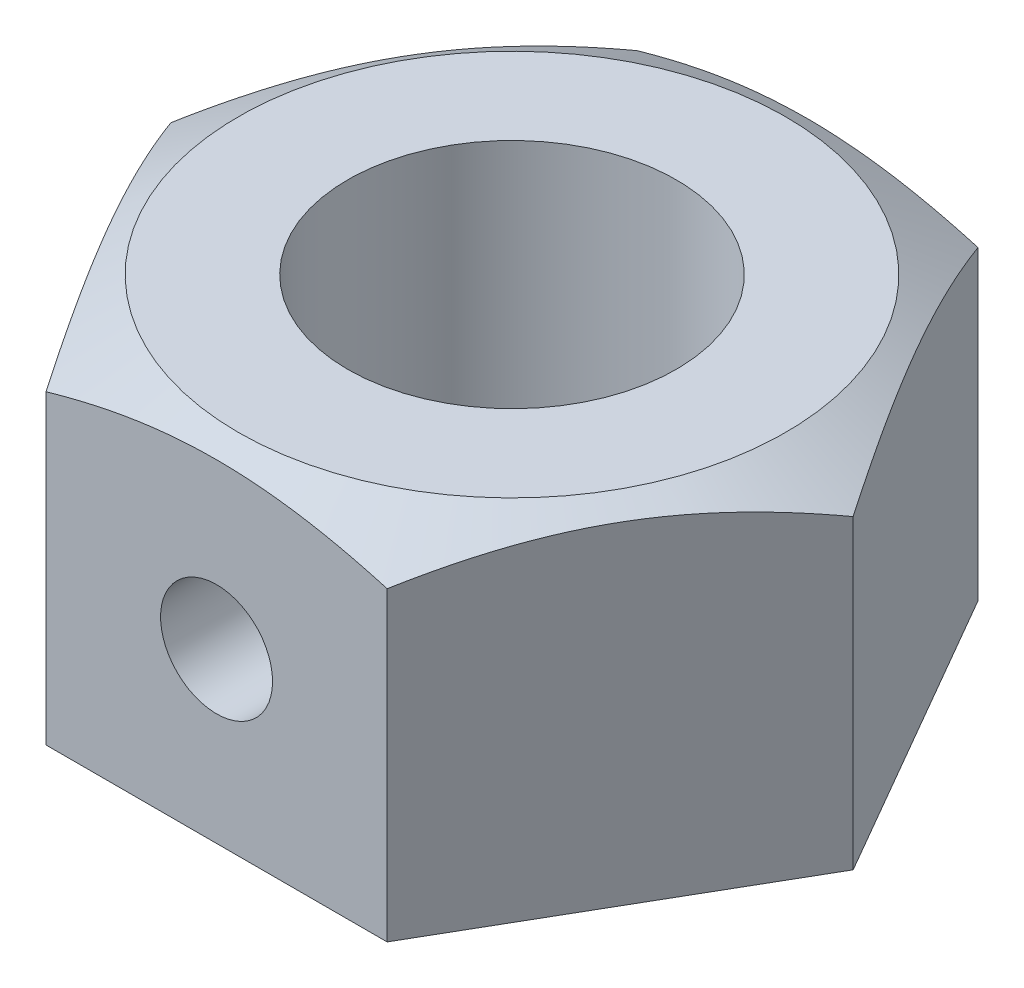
ISO-10303-21;
HEADER;
FILE_DESCRIPTION(('STEP AP214'),'2;1');
FILE_NAME('part.step','',(''),(''),'','','');
FILE_SCHEMA(('AUTOMOTIVE_DESIGN { 1 0 10303 214 1 1 1 1 }'));
ENDSEC;
DATA;
#1=APPLICATION_CONTEXT('core data for automotive mechanical design processes');
#2=APPLICATION_PROTOCOL_DEFINITION('international standard','automotive_design',2000,#1);
#3=PRODUCT_CONTEXT('',#1,'mechanical');
#4=PRODUCT('Part','Part','',(#3));
#5=PRODUCT_RELATED_PRODUCT_CATEGORY('part','',(#4));
#6=PRODUCT_DEFINITION_FORMATION('','',#4);
#7=PRODUCT_DEFINITION_CONTEXT('part definition',#1,'design');
#8=PRODUCT_DEFINITION('design','',#6,#7);
#9=PRODUCT_DEFINITION_SHAPE('','',#8);
#10=(LENGTH_UNIT() NAMED_UNIT(*) SI_UNIT(.MILLI.,.METRE.));
#11=(NAMED_UNIT(*) PLANE_ANGLE_UNIT() SI_UNIT($,.RADIAN.));
#12=(NAMED_UNIT(*) SI_UNIT($,.STERADIAN.) SOLID_ANGLE_UNIT());
#13=UNCERTAINTY_MEASURE_WITH_UNIT(LENGTH_MEASURE(1.E-05),#10,'distance_accuracy_value','');
#14=(GEOMETRIC_REPRESENTATION_CONTEXT(3) GLOBAL_UNCERTAINTY_ASSIGNED_CONTEXT((#13)) GLOBAL_UNIT_ASSIGNED_CONTEXT((#10,
#11,#12)) REPRESENTATION_CONTEXT('',''));
#15=CARTESIAN_POINT('',(0.,0.,0.));
#16=DIRECTION('',(0.,0.,1.));
#17=DIRECTION('',(1.,0.,0.));
#18=AXIS2_PLACEMENT_3D('',#15,#16,#17);
#19=CARTESIAN_POINT('',(-4.12077981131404,8.33374,7.13740000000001));
#20=DIRECTION('',(0.,0.,-1.));
#21=DIRECTION('',(-1.,0.,0.));
#22=AXIS2_PLACEMENT_3D('',#19,#20,#21);
#23=PLANE('',#22);
#24=CARTESIAN_POINT('',(0.,4.064,7.13740000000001));
#25=DIRECTION('',(0.,0.,1.));
#26=DIRECTION('',(1.,0.,0.));
#27=AXIS2_PLACEMENT_3D('',#24,#25,#26);
#28=CIRCLE('',#27,1.35254999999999);
#29=CARTESIAN_POINT('',(1.35254999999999,4.064,7.13740000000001));
#30=VERTEX_POINT('',#29);
#31=EDGE_CURVE('E1261',#30,#30,#28,.T.);
#32=ORIENTED_EDGE('',*,*,#31,.F.);
#33=EDGE_LOOP('',(#32));
#34=FACE_BOUND('',#33,.T.);
#35=CARTESIAN_POINT('',(-10.9603843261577,4.59781002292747,7.13740000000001));
#36=CARTESIAN_POINT('',(-10.6495312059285,4.74816191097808,7.13740000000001));
#37=CARTESIAN_POINT('',(-10.3379527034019,4.89704034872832,7.13740000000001));
#38=CARTESIAN_POINT('',(-9.71295871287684,5.1910193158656,7.13740000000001));
#39=CARTESIAN_POINT('',(-9.39954293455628,5.33611922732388,7.13740000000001));
#40=CARTESIAN_POINT('',(-8.76882069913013,5.62246350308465,7.13740000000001));
#41=CARTESIAN_POINT('',(-8.45150227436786,5.76368160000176,7.13740000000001));
#42=CARTESIAN_POINT('',(-7.81430318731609,6.04019133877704,7.13740000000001));
#43=CARTESIAN_POINT('',(-7.49442265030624,6.1754832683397,7.13740000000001));
#44=CARTESIAN_POINT('',(-6.84171298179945,6.44261472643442,7.13740000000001));
#45=CARTESIAN_POINT('',(-6.50878777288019,6.5742208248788,7.13740000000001));
#46=CARTESIAN_POINT('',(-5.83900334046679,6.8272071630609,7.13740000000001));
#47=CARTESIAN_POINT('',(-5.50214367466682,6.94858624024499,7.13740000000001));
#48=CARTESIAN_POINT('',(-4.82461667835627,7.17785195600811,7.13740000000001));
#49=CARTESIAN_POINT('',(-4.48395902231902,7.28576687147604,7.13740000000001));
#50=CARTESIAN_POINT('',(-3.79777170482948,7.48457190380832,7.13740000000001));
#51=CARTESIAN_POINT('',(-3.4522436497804,7.575467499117,7.13740000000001));
#52=CARTESIAN_POINT('',(-2.7579470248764,7.73531988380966,7.13740000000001));
#53=CARTESIAN_POINT('',(-2.40920547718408,7.8043908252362,7.13740000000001));
#54=CARTESIAN_POINT('',(-1.88300620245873,7.88858274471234,7.13740000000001));
#55=CARTESIAN_POINT('',(-1.7070782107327,7.91341213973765,7.13740000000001));
#56=CARTESIAN_POINT('',(-1.35438520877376,7.95611015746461,7.13740000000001));
#57=CARTESIAN_POINT('',(-1.17762028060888,7.97397944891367,7.13740000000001));
#58=CARTESIAN_POINT('',(-0.825751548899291,8.00218265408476,7.13740000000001));
#59=CARTESIAN_POINT('',(-0.650655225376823,8.01260954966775,7.13740000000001));
#60=CARTESIAN_POINT('',(-0.300178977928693,8.02605767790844,7.13740000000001));
#61=CARTESIAN_POINT('',(-0.124799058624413,8.02907903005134,7.13740000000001));
#62=CARTESIAN_POINT('',(0.22593245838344,8.02764419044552,7.13740000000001));
#63=CARTESIAN_POINT('',(0.401284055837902,8.02318793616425,7.13740000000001));
#64=CARTESIAN_POINT('',(0.751647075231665,8.00690477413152,7.13740000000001));
#65=CARTESIAN_POINT('',(0.926658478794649,7.99507747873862,7.13740000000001));
#66=CARTESIAN_POINT('',(1.3505989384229,7.95774609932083,7.13740000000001));
#67=CARTESIAN_POINT('',(1.59921024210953,7.92855986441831,7.13740000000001));
#68=CARTESIAN_POINT('',(2.09450393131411,7.8569311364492,7.13740000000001));
#69=CARTESIAN_POINT('',(2.34118603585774,7.81448674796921,7.13740000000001));
#70=CARTESIAN_POINT('',(3.07810286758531,7.66952428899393,7.13740000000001));
#71=CARTESIAN_POINT('',(3.56491649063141,7.54940591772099,7.13740000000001));
#72=CARTESIAN_POINT('',(4.29271884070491,7.34216464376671,7.13740000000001));
#73=CARTESIAN_POINT('',(4.53750806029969,7.26762997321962,7.13740000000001));
#74=CARTESIAN_POINT('',(5.02470727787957,7.11108354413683,7.13740000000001));
#75=CARTESIAN_POINT('',(5.26711726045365,7.02907173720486,7.1374));
#76=CARTESIAN_POINT('',(5.74963966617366,6.85886483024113,7.1374));
#77=CARTESIAN_POINT('',(5.98975287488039,6.7706719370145,7.1374));
#78=CARTESIAN_POINT('',(6.4680075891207,6.58911411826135,7.1374));
#79=CARTESIAN_POINT('',(6.7061491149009,6.49574924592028,7.1374));
#80=CARTESIAN_POINT('',(7.25623375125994,6.27429607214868,7.1374));
#81=CARTESIAN_POINT('',(7.56753490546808,6.14461637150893,7.1374));
#82=CARTESIAN_POINT('',(8.18760252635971,5.87931600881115,7.1374));
#83=CARTESIAN_POINT('',(8.49636885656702,5.74369502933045,7.1374));
#84=CARTESIAN_POINT('',(9.11181883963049,5.46767389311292,7.1374));
#85=CARTESIAN_POINT('',(9.41850210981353,5.32727288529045,7.1374));
#86=CARTESIAN_POINT('',(10.0300802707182,5.0426218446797,7.1374));
#87=CARTESIAN_POINT('',(10.3349751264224,4.8983717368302,7.1374));
#88=CARTESIAN_POINT('',(10.9435537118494,4.60658664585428,7.1374));
#89=CARTESIAN_POINT('',(11.2472359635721,4.45904858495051,7.1374));
#90=CARTESIAN_POINT('',(11.8533233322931,4.16136983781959,7.1374));
#91=CARTESIAN_POINT('',(12.1557284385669,4.01122912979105,7.1374));
#92=CARTESIAN_POINT('',(13.0612540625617,3.55761431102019,7.1374));
#93=CARTESIAN_POINT('',(13.6627575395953,3.25091239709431,7.1374));
#94=CARTESIAN_POINT('',(14.8143604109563,2.65631457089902,7.1374));
#95=CARTESIAN_POINT('',(15.3647039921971,2.36888955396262,7.1374));
#96=CARTESIAN_POINT('',(16.4633511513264,1.79012802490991,7.1374));
#97=CARTESIAN_POINT('',(17.0116546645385,1.49879139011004,7.1374));
#98=CARTESIAN_POINT('',(18.1054046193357,0.913798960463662,7.1374));
#99=CARTESIAN_POINT('',(18.6508547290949,0.62015001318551,7.1374));
#100=CARTESIAN_POINT('',(19.7404438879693,0.030494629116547,7.1374));
#101=CARTESIAN_POINT('',(20.2845830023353,-0.265511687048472,7.1374));
#102=CARTESIAN_POINT('',(20.8282361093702,-0.562402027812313,7.1374));
#103=B_SPLINE_CURVE_WITH_KNOTS('',3,(#35,#36,#37,#38,#39,#40,#41,#42,#43,#44,#45,#46,#47,#48,
#49,#50,#51,#52,#53,#54,#55,#56,#57,#58,#59,#60,#61,#62,#63,#64,#65,#66,#67,#68,#69,#70,#71,#72,
#73,#74,#75,#76,#77,#78,#79,#80,#81,#82,#83,#84,#85,#86,#87,#88,#89,#90,#91,#92,#93,#94,#95,#96,
#97,#98,#99,#100,#101,#102),.UNSPECIFIED.,.F.,.F.,(4,2,2,2,2,2,2,2,2,2,2,2,2,2,2,2,2,2,2,2,2,2,
2,2,2,2,2,2,2,2,2,2,2,4),(0.,1.0359273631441,2.07202308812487,3.11394475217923,4.15581577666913,
5.22966604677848,6.30363822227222,7.3753154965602,8.44664720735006,9.51227891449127,
10.0451772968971,10.5780244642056,11.1040920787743,11.6301512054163,12.1562147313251,
12.6823059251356,13.4328354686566,14.1834723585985,15.6856214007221,16.4532161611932,
17.2208158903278,17.9881429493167,18.755462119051,19.7670753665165,20.778742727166,
21.790591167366,22.8024593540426,23.8153182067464,24.828185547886,26.8536781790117,
28.7162994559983,30.5789792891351,32.4373890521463,34.2957043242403),.UNSPECIFIED.);
#104=CARTESIAN_POINT('',(-4.12077981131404,7.3909781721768,7.13740000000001));
#105=VERTEX_POINT('',#104);
#106=CARTESIAN_POINT('',(4.12077981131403,7.3909781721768,7.13740000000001));
#107=VERTEX_POINT('',#106);
#108=EDGE_CURVE('E1253',#105,#107,#103,.T.);
#109=ORIENTED_EDGE('',*,*,#108,.F.);
#110=DIRECTION('',(0.,-1.,0.));
#111=VECTOR('',#110,1.);
#112=CARTESIAN_POINT('',(-4.12077981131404,8.33374,7.13740000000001));
#113=LINE('',#112,#111);
#114=CARTESIAN_POINT('',(-4.12077981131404,0.,7.13740000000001));
#115=VERTEX_POINT('',#114);
#116=EDGE_CURVE('E1259',#105,#115,#113,.T.);
#117=ORIENTED_EDGE('',*,*,#116,.T.);
#118=DIRECTION('',(1.,0.,0.));
#119=VECTOR('',#118,1.);
#120=CARTESIAN_POINT('',(-4.12077981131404,0.,7.13740000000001));
#121=LINE('',#120,#119);
#122=CARTESIAN_POINT('',(4.12077981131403,0.,7.13740000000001));
#123=VERTEX_POINT('',#122);
#124=EDGE_CURVE('E1272',#115,#123,#121,.T.);
#125=ORIENTED_EDGE('',*,*,#124,.T.);
#126=DIRECTION('',(0.,-1.,0.));
#127=VECTOR('',#126,1.);
#128=CARTESIAN_POINT('',(4.12077981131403,8.33374,7.13740000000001));
#129=LINE('',#128,#127);
#130=EDGE_CURVE('E1222',#107,#123,#129,.T.);
#131=ORIENTED_EDGE('',*,*,#130,.F.);
#132=EDGE_LOOP('',(#109,#117,#125,#131));
#133=FACE_BOUND('',#132,.T.);
#134=ADVANCED_FACE('F1197',(#34,#133),#23,.F.);
#135=CARTESIAN_POINT('',(4.12077981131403,8.33374,7.13740000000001));
#136=DIRECTION('',(-0.866025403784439,0.,-0.5));
#137=DIRECTION('',(-0.5,0.,0.866025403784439));
#138=AXIS2_PLACEMENT_3D('',#135,#136,#137);
#139=PLANE('',#138);
#140=CARTESIAN_POINT('',(4.12066434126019,7.39091150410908,7.13760000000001));
#141=CARTESIAN_POINT('',(4.21124371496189,7.44319963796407,6.98071192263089));
#142=CARTESIAN_POINT('',(4.30216081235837,7.49311473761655,6.82323889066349));
#143=CARTESIAN_POINT('',(4.48473335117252,7.58754528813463,6.50701397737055));
#144=CARTESIAN_POINT('',(4.57638909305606,7.63205840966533,6.34826157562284));
#145=CARTESIAN_POINT('',(4.85282383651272,7.75662108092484,5.86946255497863));
#146=CARTESIAN_POINT('',(5.03869401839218,7.82747090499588,5.54752595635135));
#147=CARTESIAN_POINT('',(5.31684536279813,7.91055067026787,5.06575369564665));
#148=CARTESIAN_POINT('',(5.40829544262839,7.93421768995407,4.90735751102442));
#149=CARTESIAN_POINT('',(5.59160881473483,7.97390382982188,4.58984943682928));
#150=CARTESIAN_POINT('',(5.68347206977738,7.98992362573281,4.43073761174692));
#151=CARTESIAN_POINT('',(5.86735812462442,8.01390704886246,4.11223762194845));
#152=CARTESIAN_POINT('',(5.95938062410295,8.02187981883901,3.95284997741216));
#153=CARTESIAN_POINT('',(6.14350554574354,8.02960678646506,3.63393625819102));
#154=CARTESIAN_POINT('',(6.23560796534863,8.0293612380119,3.47441018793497));
#155=CARTESIAN_POINT('',(6.48793781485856,8.01739197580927,3.03736206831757));
#156=CARTESIAN_POINT('',(6.64808264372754,7.99729914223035,2.75998308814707));
#157=CARTESIAN_POINT('',(6.96730863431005,7.93358493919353,2.20706745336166));
#158=CARTESIAN_POINT('',(7.12638867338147,7.88994179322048,1.93153274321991));
#159=CARTESIAN_POINT('',(7.44625708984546,7.78084672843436,1.37750439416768));
#160=CARTESIAN_POINT('',(7.60700510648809,7.71493259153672,1.09908066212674));
#161=CARTESIAN_POINT('',(7.92610395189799,7.56533414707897,0.546385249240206));
#162=CARTESIAN_POINT('',(8.08445886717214,7.48168497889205,0.272106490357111));
#163=CARTESIAN_POINT('',(8.24167509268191,7.39091150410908,-0.00020000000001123));
#164=B_SPLINE_CURVE_WITH_KNOTS('',3,(#140,#141,#142,#143,#144,#145,#146,#147,#148,#149,#150,
#151,#152,#153,#154,#155,#156,#157,#158,#159,#160,#161,#162,#163),.UNSPECIFIED.,.F.,.F.,(4,2,2,
2,2,2,2,2,2,2,2,4),(0.,0.565616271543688,1.13147557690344,2.26554547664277,2.81869146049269,
3.37178855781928,3.9242565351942,4.47670744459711,5.43845614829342,6.40109569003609,
7.38508511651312,8.36714283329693),.UNSPECIFIED.);
#165=CARTESIAN_POINT('',(8.24155962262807,7.3909781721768,0.));
#166=VERTEX_POINT('',#165);
#167=EDGE_CURVE('E1262',#107,#166,#164,.T.);
#168=ORIENTED_EDGE('',*,*,#167,.F.);
#169=ORIENTED_EDGE('',*,*,#130,.T.);
#170=DIRECTION('',(0.5,0.,-0.866025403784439));
#171=VECTOR('',#170,1.);
#172=CARTESIAN_POINT('',(4.12077981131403,0.,7.13740000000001));
#173=LINE('',#172,#171);
#174=CARTESIAN_POINT('',(8.24155962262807,0.,0.));
#175=VERTEX_POINT('',#174);
#176=EDGE_CURVE('E1296',#123,#175,#173,.T.);
#177=ORIENTED_EDGE('',*,*,#176,.T.);
#178=DIRECTION('',(0.,-1.,0.));
#179=VECTOR('',#178,1.);
#180=CARTESIAN_POINT('',(8.24155962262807,8.33374,0.));
#181=LINE('',#180,#179);
#182=EDGE_CURVE('E12',#166,#175,#181,.T.);
#183=ORIENTED_EDGE('',*,*,#182,.F.);
#184=EDGE_LOOP('',(#168,#169,#177,#183));
#185=FACE_BOUND('',#184,.T.);
#186=ADVANCED_FACE('F1199',(#185),#139,.F.);
#187=CARTESIAN_POINT('',(8.24155962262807,8.33374,0.));
#188=DIRECTION('',(-0.866025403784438,0.,0.5));
#189=DIRECTION('',(0.5,0.,0.866025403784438));
#190=AXIS2_PLACEMENT_3D('',#187,#188,#189);
#191=PLANE('',#190);
#192=CARTESIAN_POINT('',(8.24167509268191,7.39091150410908,0.000199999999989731));
#193=CARTESIAN_POINT('',(8.15109571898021,7.44319963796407,-0.156688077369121));
#194=CARTESIAN_POINT('',(8.06017862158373,7.49311473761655,-0.314161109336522));
#195=CARTESIAN_POINT('',(7.87760608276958,7.58754528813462,-0.630386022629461));
#196=CARTESIAN_POINT('',(7.78595034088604,7.63205840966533,-0.789138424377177));
#197=CARTESIAN_POINT('',(7.50951559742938,7.75662108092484,-1.26793744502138));
#198=CARTESIAN_POINT('',(7.32364541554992,7.82747090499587,-1.58987404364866));
#199=CARTESIAN_POINT('',(7.04549407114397,7.91055067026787,-2.07164630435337));
#200=CARTESIAN_POINT('',(6.95404399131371,7.93421768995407,-2.2300424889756));
#201=CARTESIAN_POINT('',(6.77073061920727,7.97390382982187,-2.54755056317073));
#202=CARTESIAN_POINT('',(6.67886736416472,7.9899236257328,-2.70666238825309));
#203=CARTESIAN_POINT('',(6.49498130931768,8.01390704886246,-3.02516237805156));
#204=CARTESIAN_POINT('',(6.40295880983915,8.02187981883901,-3.18455002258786));
#205=CARTESIAN_POINT('',(6.21883388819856,8.02960678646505,-3.503463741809));
#206=CARTESIAN_POINT('',(6.12673146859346,8.0293612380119,-3.66298981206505));
#207=CARTESIAN_POINT('',(5.87440161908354,8.01739197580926,-4.10003793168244));
#208=CARTESIAN_POINT('',(5.71425679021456,7.99729914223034,-4.37741691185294));
#209=CARTESIAN_POINT('',(5.39503079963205,7.93358493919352,-4.93033254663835));
#210=CARTESIAN_POINT('',(5.23595076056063,7.88994179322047,-5.2058672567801));
#211=CARTESIAN_POINT('',(4.91608234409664,7.78084672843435,-5.75989560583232));
#212=CARTESIAN_POINT('',(4.75533432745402,7.71493259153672,-6.03831933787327));
#213=CARTESIAN_POINT('',(4.43623548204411,7.56533414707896,-6.5910147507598));
#214=CARTESIAN_POINT('',(4.27788056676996,7.48168497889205,-6.86529350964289));
#215=CARTESIAN_POINT('',(4.12066434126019,7.39091150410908,-7.13760000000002));
#216=B_SPLINE_CURVE_WITH_KNOTS('',3,(#192,#193,#194,#195,#196,#197,#198,#199,#200,#201,#202,
#203,#204,#205,#206,#207,#208,#209,#210,#211,#212,#213,#214,#215),.UNSPECIFIED.,.F.,.F.,(4,2,2,
2,2,2,2,2,2,2,2,4),(0.,0.565616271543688,1.13147557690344,2.26554547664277,2.81869146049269,
3.37178855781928,3.92425653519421,4.47670744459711,5.43845614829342,6.40109569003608,
7.38508511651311,8.36714283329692),.UNSPECIFIED.);
#217=CARTESIAN_POINT('',(4.12077981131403,7.3909781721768,-7.13740000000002));
#218=VERTEX_POINT('',#217);
#219=EDGE_CURVE('E1350',#166,#218,#216,.T.);
#220=ORIENTED_EDGE('',*,*,#219,.F.);
#221=ORIENTED_EDGE('',*,*,#182,.T.);
#222=DIRECTION('',(-0.5,0.,-0.866025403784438));
#223=VECTOR('',#222,1.);
#224=CARTESIAN_POINT('',(8.24155962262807,0.,0.));
#225=LINE('',#224,#223);
#226=CARTESIAN_POINT('',(4.12077981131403,0.,-7.13740000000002));
#227=VERTEX_POINT('',#226);
#228=EDGE_CURVE('E1291',#175,#227,#225,.T.);
#229=ORIENTED_EDGE('',*,*,#228,.T.);
#230=DIRECTION('',(0.,-1.,0.));
#231=VECTOR('',#230,1.);
#232=CARTESIAN_POINT('',(4.12077981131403,8.33374,-7.13740000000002));
#233=LINE('',#232,#231);
#234=EDGE_CURVE('E1207',#218,#227,#233,.T.);
#235=ORIENTED_EDGE('',*,*,#234,.F.);
#236=EDGE_LOOP('',(#220,#221,#229,#235));
#237=FACE_BOUND('',#236,.T.);
#238=ADVANCED_FACE('F1292',(#237),#191,.F.);
#239=CARTESIAN_POINT('',(4.12077981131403,8.33374,-7.13740000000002));
#240=DIRECTION('',(0.,0.,1.));
#241=DIRECTION('',(1.,0.,0.));
#242=AXIS2_PLACEMENT_3D('',#239,#240,#241);
#243=PLANE('',#242);
#244=CARTESIAN_POINT('',(-10.9603843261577,4.59781002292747,-7.13740000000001));
#245=CARTESIAN_POINT('',(-10.6495312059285,4.74816191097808,-7.13740000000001));
#246=CARTESIAN_POINT('',(-10.3379527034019,4.89704034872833,-7.13740000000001));
#247=CARTESIAN_POINT('',(-9.71295871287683,5.1910193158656,-7.13740000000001));
#248=CARTESIAN_POINT('',(-9.39954293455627,5.33611922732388,-7.13740000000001));
#249=CARTESIAN_POINT('',(-8.76882069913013,5.62246350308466,-7.13740000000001));
#250=CARTESIAN_POINT('',(-8.45150227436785,5.76368160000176,-7.13740000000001));
#251=CARTESIAN_POINT('',(-7.81430318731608,6.04019133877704,-7.13740000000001));
#252=CARTESIAN_POINT('',(-7.49442265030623,6.1754832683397,-7.13740000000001));
#253=CARTESIAN_POINT('',(-6.84171298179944,6.44261472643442,-7.13740000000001));
#254=CARTESIAN_POINT('',(-6.50878777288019,6.57422082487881,-7.13740000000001));
#255=CARTESIAN_POINT('',(-5.83900334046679,6.8272071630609,-7.13740000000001));
#256=CARTESIAN_POINT('',(-5.50214367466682,6.94858624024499,-7.13740000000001));
#257=CARTESIAN_POINT('',(-4.82461667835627,7.17785195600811,-7.13740000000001));
#258=CARTESIAN_POINT('',(-4.48395902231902,7.28576687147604,-7.13740000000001));
#259=CARTESIAN_POINT('',(-3.79777170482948,7.48457190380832,-7.13740000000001));
#260=CARTESIAN_POINT('',(-3.45224364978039,7.575467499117,-7.13740000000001));
#261=CARTESIAN_POINT('',(-2.75794702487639,7.73531988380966,-7.13740000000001));
#262=CARTESIAN_POINT('',(-2.40920547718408,7.80439082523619,-7.13740000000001));
#263=CARTESIAN_POINT('',(-1.88300620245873,7.88858274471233,-7.13740000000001));
#264=CARTESIAN_POINT('',(-1.7070782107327,7.91341213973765,-7.13740000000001));
#265=CARTESIAN_POINT('',(-1.35438520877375,7.95611015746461,-7.13740000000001));
#266=CARTESIAN_POINT('',(-1.17762028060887,7.97397944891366,-7.13740000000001));
#267=CARTESIAN_POINT('',(-0.825751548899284,8.00218265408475,-7.13740000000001));
#268=CARTESIAN_POINT('',(-0.650655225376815,8.01260954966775,-7.13740000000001));
#269=CARTESIAN_POINT('',(-0.300178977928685,8.02605767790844,-7.13740000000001));
#270=CARTESIAN_POINT('',(-0.124799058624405,8.02907903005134,-7.13740000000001));
#271=CARTESIAN_POINT('',(0.225932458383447,8.02764419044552,-7.13740000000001));
#272=CARTESIAN_POINT('',(0.40128405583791,8.02318793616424,-7.13740000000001));
#273=CARTESIAN_POINT('',(0.751647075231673,8.00690477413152,-7.13740000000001));
#274=CARTESIAN_POINT('',(0.926658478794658,7.99507747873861,-7.13740000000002));
#275=CARTESIAN_POINT('',(1.35059893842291,7.95774609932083,-7.13740000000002));
#276=CARTESIAN_POINT('',(1.59921024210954,7.92855986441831,-7.13740000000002));
#277=CARTESIAN_POINT('',(2.09450393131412,7.8569311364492,-7.13740000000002));
#278=CARTESIAN_POINT('',(2.34118603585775,7.8144867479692,-7.13740000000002));
#279=CARTESIAN_POINT('',(3.07810286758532,7.66952428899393,-7.13740000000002));
#280=CARTESIAN_POINT('',(3.56491649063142,7.54940591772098,-7.13740000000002));
#281=CARTESIAN_POINT('',(4.29271884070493,7.3421646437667,-7.13740000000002));
#282=CARTESIAN_POINT('',(4.53750806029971,7.2676299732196,-7.13740000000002));
#283=CARTESIAN_POINT('',(5.02470727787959,7.11108354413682,-7.13740000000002));
#284=CARTESIAN_POINT('',(5.26711726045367,7.02907173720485,-7.13740000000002));
#285=CARTESIAN_POINT('',(5.74963966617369,6.85886483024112,-7.13740000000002));
#286=CARTESIAN_POINT('',(5.98975287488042,6.77067193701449,-7.13740000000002));
#287=CARTESIAN_POINT('',(6.46800758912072,6.58911411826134,-7.13740000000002));
#288=CARTESIAN_POINT('',(6.70614911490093,6.49574924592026,-7.13740000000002));
#289=CARTESIAN_POINT('',(7.25623375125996,6.27429607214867,-7.13740000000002));
#290=CARTESIAN_POINT('',(7.5675349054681,6.14461637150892,-7.13740000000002));
#291=CARTESIAN_POINT('',(8.18760252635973,5.87931600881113,-7.13740000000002));
#292=CARTESIAN_POINT('',(8.49636885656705,5.74369502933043,-7.13740000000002));
#293=CARTESIAN_POINT('',(9.11181883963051,5.46767389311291,-7.13740000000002));
#294=CARTESIAN_POINT('',(9.41850210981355,5.32727288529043,-7.13740000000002));
#295=CARTESIAN_POINT('',(10.0300802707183,5.04262184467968,-7.13740000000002));
#296=CARTESIAN_POINT('',(10.3349751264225,4.89837173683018,-7.13740000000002));
#297=CARTESIAN_POINT('',(10.9435537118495,4.60658664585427,-7.13740000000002));
#298=CARTESIAN_POINT('',(11.2472359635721,4.4590485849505,-7.13740000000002));
#299=CARTESIAN_POINT('',(11.8533233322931,4.16136983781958,-7.13740000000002));
#300=CARTESIAN_POINT('',(12.1557284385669,4.01122912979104,-7.13740000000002));
#301=CARTESIAN_POINT('',(13.0612540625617,3.55761431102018,-7.13740000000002));
#302=CARTESIAN_POINT('',(13.6627575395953,3.2509123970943,-7.13740000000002));
#303=CARTESIAN_POINT('',(14.8143604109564,2.656314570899,-7.13740000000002));
#304=CARTESIAN_POINT('',(15.3647039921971,2.36888955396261,-7.13740000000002));
#305=CARTESIAN_POINT('',(16.4633511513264,1.79012802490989,-7.13740000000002));
#306=CARTESIAN_POINT('',(17.0116546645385,1.49879139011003,-7.13740000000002));
#307=CARTESIAN_POINT('',(18.1054046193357,0.913798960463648,-7.13740000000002));
#308=CARTESIAN_POINT('',(18.650854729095,0.620150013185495,-7.13740000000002));
#309=CARTESIAN_POINT('',(19.7404438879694,0.0304946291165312,-7.13740000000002));
#310=CARTESIAN_POINT('',(20.2845830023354,-0.265511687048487,-7.13740000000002));
#311=CARTESIAN_POINT('',(20.8282361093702,-0.562402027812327,-7.13740000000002));
#312=B_SPLINE_CURVE_WITH_KNOTS('',3,(#244,#245,#246,#247,#248,#249,#250,#251,#252,#253,#254,
#255,#256,#257,#258,#259,#260,#261,#262,#263,#264,#265,#266,#267,#268,#269,#270,#271,#272,#273,
#274,#275,#276,#277,#278,#279,#280,#281,#282,#283,#284,#285,#286,#287,#288,#289,#290,#291,#292,
#293,#294,#295,#296,#297,#298,#299,#300,#301,#302,#303,#304,#305,#306,#307,#308,#309,#310,#311),
.UNSPECIFIED.,.F.,.F.,(4,2,2,2,2,2,2,2,2,2,2,2,2,2,2,2,2,2,2,2,2,2,2,2,2,2,2,2,2,2,2,2,2,4),(0.,
1.0359273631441,2.07202308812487,3.11394475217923,4.15581577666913,5.22966604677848,
6.30363822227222,7.3753154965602,8.44664720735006,9.51227891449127,10.0451772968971,
10.5780244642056,11.1040920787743,11.6301512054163,12.1562147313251,12.6823059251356,
13.4328354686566,14.1834723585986,15.6856214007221,16.4532161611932,17.2208158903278,
17.9881429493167,18.755462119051,19.7670753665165,20.778742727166,21.790591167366,
22.8024593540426,23.8153182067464,24.828185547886,26.8536781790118,28.7162994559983,
30.5789792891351,32.4373890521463,34.2957043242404),.UNSPECIFIED.);
#313=CARTESIAN_POINT('',(-4.12077981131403,7.3909781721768,-7.13740000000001));
#314=VERTEX_POINT('',#313);
#315=EDGE_CURVE('E1287',#218,#314,#312,.F.);
#316=ORIENTED_EDGE('',*,*,#315,.F.);
#317=ORIENTED_EDGE('',*,*,#234,.T.);
#318=DIRECTION('',(-1.,0.,0.));
#319=VECTOR('',#318,1.);
#320=CARTESIAN_POINT('',(4.12077981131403,0.,-7.13740000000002));
#321=LINE('',#320,#319);
#322=CARTESIAN_POINT('',(-4.12077981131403,0.,-7.13740000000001));
#323=VERTEX_POINT('',#322);
#324=EDGE_CURVE('E1285',#227,#323,#321,.T.);
#325=ORIENTED_EDGE('',*,*,#324,.T.);
#326=DIRECTION('',(0.,-1.,0.));
#327=VECTOR('',#326,1.);
#328=CARTESIAN_POINT('',(-4.12077981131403,8.33374,-7.13740000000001));
#329=LINE('',#328,#327);
#330=EDGE_CURVE('E1270',#314,#323,#329,.T.);
#331=ORIENTED_EDGE('',*,*,#330,.F.);
#332=EDGE_LOOP('',(#316,#317,#325,#331));
#333=FACE_BOUND('',#332,.T.);
#334=ADVANCED_FACE('F1282',(#333),#243,.F.);
#335=CARTESIAN_POINT('',(-4.12077981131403,8.33374,-7.13740000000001));
#336=DIRECTION('',(0.866025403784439,0.,0.5));
#337=DIRECTION('',(0.5,0.,-0.866025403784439));
#338=AXIS2_PLACEMENT_3D('',#335,#336,#337);
#339=PLANE('',#338);
#340=CARTESIAN_POINT('',(-4.12066434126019,7.39091150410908,-7.13760000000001));
#341=CARTESIAN_POINT('',(-4.21124371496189,7.44319963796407,-6.9807119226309));
#342=CARTESIAN_POINT('',(-4.30216081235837,7.49311473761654,-6.8232388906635));
#343=CARTESIAN_POINT('',(-4.48473335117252,7.58754528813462,-6.50701397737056));
#344=CARTESIAN_POINT('',(-4.57638909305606,7.63205840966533,-6.34826157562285));
#345=CARTESIAN_POINT('',(-4.85282383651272,7.75662108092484,-5.86946255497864));
#346=CARTESIAN_POINT('',(-5.03869401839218,7.82747090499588,-5.54752595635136));
#347=CARTESIAN_POINT('',(-5.31684536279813,7.91055067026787,-5.06575369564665));
#348=CARTESIAN_POINT('',(-5.40829544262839,7.93421768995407,-4.90735751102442));
#349=CARTESIAN_POINT('',(-5.59160881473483,7.97390382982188,-4.58984943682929));
#350=CARTESIAN_POINT('',(-5.68347206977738,7.98992362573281,-4.43073761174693));
#351=CARTESIAN_POINT('',(-5.86735812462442,8.01390704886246,-4.11223762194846));
#352=CARTESIAN_POINT('',(-5.95938062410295,8.02187981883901,-3.95284997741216));
#353=CARTESIAN_POINT('',(-6.14350554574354,8.02960678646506,-3.63393625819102));
#354=CARTESIAN_POINT('',(-6.23560796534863,8.0293612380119,-3.47441018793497));
#355=CARTESIAN_POINT('',(-6.48793781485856,8.01739197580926,-3.03736206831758));
#356=CARTESIAN_POINT('',(-6.64808264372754,7.99729914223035,-2.75998308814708));
#357=CARTESIAN_POINT('',(-6.96730863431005,7.93358493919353,-2.20706745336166));
#358=CARTESIAN_POINT('',(-7.12638867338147,7.88994179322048,-1.93153274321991));
#359=CARTESIAN_POINT('',(-7.44625708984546,7.78084672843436,-1.37750439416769));
#360=CARTESIAN_POINT('',(-7.60700510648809,7.71493259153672,-1.09908066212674));
#361=CARTESIAN_POINT('',(-7.92610395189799,7.56533414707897,-0.546385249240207));
#362=CARTESIAN_POINT('',(-8.08445886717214,7.48168497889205,-0.272106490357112));
#363=CARTESIAN_POINT('',(-8.24167509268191,7.39091150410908,0.000200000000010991));
#364=B_SPLINE_CURVE_WITH_KNOTS('',3,(#340,#341,#342,#343,#344,#345,#346,#347,#348,#349,#350,
#351,#352,#353,#354,#355,#356,#357,#358,#359,#360,#361,#362,#363),.UNSPECIFIED.,.F.,.F.,(4,2,2,
2,2,2,2,2,2,2,2,4),(0.,0.565616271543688,1.13147557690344,2.26554547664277,2.81869146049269,
3.37178855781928,3.92425653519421,4.47670744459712,5.43845614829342,6.40109569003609,
7.38508511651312,8.36714283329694),.UNSPECIFIED.);
#365=CARTESIAN_POINT('',(-8.24155962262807,7.3909781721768,0.));
#366=VERTEX_POINT('',#365);
#367=EDGE_CURVE('E1214',#314,#366,#364,.T.);
#368=ORIENTED_EDGE('',*,*,#367,.F.);
#369=ORIENTED_EDGE('',*,*,#330,.T.);
#370=DIRECTION('',(-0.5,0.,0.866025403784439));
#371=VECTOR('',#370,1.);
#372=CARTESIAN_POINT('',(-4.12077981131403,0.,-7.13740000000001));
#373=LINE('',#372,#371);
#374=CARTESIAN_POINT('',(-8.24155962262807,0.,0.));
#375=VERTEX_POINT('',#374);
#376=EDGE_CURVE('E1300',#323,#375,#373,.T.);
#377=ORIENTED_EDGE('',*,*,#376,.T.);
#378=DIRECTION('',(0.,-1.,0.));
#379=VECTOR('',#378,1.);
#380=CARTESIAN_POINT('',(-8.24155962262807,8.33374,0.));
#381=LINE('',#380,#379);
#382=EDGE_CURVE('E1268',#366,#375,#381,.T.);
#383=ORIENTED_EDGE('',*,*,#382,.F.);
#384=EDGE_LOOP('',(#368,#369,#377,#383));
#385=FACE_BOUND('',#384,.T.);
#386=ADVANCED_FACE('F1370',(#385),#339,.F.);
#387=CARTESIAN_POINT('',(-8.24155962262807,8.33374,0.));
#388=DIRECTION('',(0.866025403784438,0.,-0.5));
#389=DIRECTION('',(-0.5,0.,-0.866025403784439));
#390=AXIS2_PLACEMENT_3D('',#387,#388,#389);
#391=PLANE('',#390);
#392=CARTESIAN_POINT('',(-8.24167509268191,7.39091150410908,-0.000199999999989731));
#393=CARTESIAN_POINT('',(-8.15109571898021,7.44319963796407,0.156688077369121));
#394=CARTESIAN_POINT('',(-8.06017862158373,7.49311473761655,0.314161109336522));
#395=CARTESIAN_POINT('',(-7.87760608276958,7.58754528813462,0.630386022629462));
#396=CARTESIAN_POINT('',(-7.78595034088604,7.63205840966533,0.789138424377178));
#397=CARTESIAN_POINT('',(-7.50951559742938,7.75662108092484,1.26793744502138));
#398=CARTESIAN_POINT('',(-7.32364541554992,7.82747090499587,1.58987404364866));
#399=CARTESIAN_POINT('',(-7.04549407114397,7.91055067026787,2.07164630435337));
#400=CARTESIAN_POINT('',(-6.95404399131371,7.93421768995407,2.2300424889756));
#401=CARTESIAN_POINT('',(-6.77073061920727,7.97390382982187,2.54755056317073));
#402=CARTESIAN_POINT('',(-6.67886736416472,7.9899236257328,2.70666238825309));
#403=CARTESIAN_POINT('',(-6.49498130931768,8.01390704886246,3.02516237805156));
#404=CARTESIAN_POINT('',(-6.40295880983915,8.02187981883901,3.18455002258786));
#405=CARTESIAN_POINT('',(-6.21883388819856,8.02960678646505,3.503463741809));
#406=CARTESIAN_POINT('',(-6.12673146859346,8.0293612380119,3.66298981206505));
#407=CARTESIAN_POINT('',(-5.87440161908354,8.01739197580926,4.10003793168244));
#408=CARTESIAN_POINT('',(-5.71425679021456,7.99729914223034,4.37741691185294));
#409=CARTESIAN_POINT('',(-5.39503079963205,7.93358493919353,4.93033254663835));
#410=CARTESIAN_POINT('',(-5.23595076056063,7.88994179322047,5.2058672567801));
#411=CARTESIAN_POINT('',(-4.91608234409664,7.78084672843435,5.75989560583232));
#412=CARTESIAN_POINT('',(-4.75533432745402,7.71493259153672,6.03831933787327));
#413=CARTESIAN_POINT('',(-4.43623548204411,7.56533414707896,6.59101475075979));
#414=CARTESIAN_POINT('',(-4.27788056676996,7.48168497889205,6.86529350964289));
#415=CARTESIAN_POINT('',(-4.1206643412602,7.39091150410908,7.13760000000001));
#416=B_SPLINE_CURVE_WITH_KNOTS('',3,(#392,#393,#394,#395,#396,#397,#398,#399,#400,#401,#402,
#403,#404,#405,#406,#407,#408,#409,#410,#411,#412,#413,#414,#415),.UNSPECIFIED.,.F.,.F.,(4,2,2,
2,2,2,2,2,2,2,2,4),(0.,0.565616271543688,1.13147557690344,2.26554547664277,2.81869146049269,
3.37178855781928,3.92425653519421,4.47670744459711,5.43845614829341,6.40109569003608,
7.3850851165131,8.36714283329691),.UNSPECIFIED.);
#417=EDGE_CURVE('E1250',#366,#105,#416,.T.);
#418=ORIENTED_EDGE('',*,*,#417,.F.);
#419=ORIENTED_EDGE('',*,*,#382,.T.);
#420=DIRECTION('',(0.5,0.,0.866025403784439));
#421=VECTOR('',#420,1.);
#422=CARTESIAN_POINT('',(-8.24155962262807,0.,0.));
#423=LINE('',#422,#421);
#424=EDGE_CURVE('E1266',#375,#115,#423,.T.);
#425=ORIENTED_EDGE('',*,*,#424,.T.);
#426=ORIENTED_EDGE('',*,*,#116,.F.);
#427=EDGE_LOOP('',(#418,#419,#425,#426));
#428=FACE_BOUND('',#427,.T.);
#429=ADVANCED_FACE('F1264',(#428),#391,.F.);
#430=CARTESIAN_POINT('',(8.24155962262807,8.33374,0.));
#431=DIRECTION('',(0.,1.,0.));
#432=DIRECTION('',(0.,0.,1.));
#433=AXIS2_PLACEMENT_3D('',#430,#431,#432);
#434=PLANE('',#433);
#435=CARTESIAN_POINT('',(0.,8.33374,0.));
#436=DIRECTION('',(0.,1.,0.));
#437=DIRECTION('',(0.,0.,1.));
#438=AXIS2_PLACEMENT_3D('',#435,#436,#437);
#439=CIRCLE('',#438,3.96874999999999);
#440=CARTESIAN_POINT('',(0.,8.33374,3.96874999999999));
#441=VERTEX_POINT('',#440);
#442=EDGE_CURVE('E1307',#441,#441,#439,.T.);
#443=ORIENTED_EDGE('',*,*,#442,.F.);
#444=EDGE_LOOP('',(#443));
#445=FACE_BOUND('',#444,.T.);
#446=CARTESIAN_POINT('',(0.,8.33374,0.));
#447=DIRECTION('',(0.,1.,0.));
#448=DIRECTION('',(0.,0.,1.));
#449=AXIS2_PLACEMENT_3D('',#446,#447,#448);
#450=CIRCLE('',#449,6.60864823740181);
#451=CARTESIAN_POINT('',(0.,8.33374,6.60864823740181));
#452=VERTEX_POINT('',#451);
#453=EDGE_CURVE('E1202',#452,#452,#450,.T.);
#454=ORIENTED_EDGE('',*,*,#453,.T.);
#455=EDGE_LOOP('',(#454));
#456=FACE_BOUND('',#455,.T.);
#457=ADVANCED_FACE('F1366',(#445,#456),#434,.T.);
#458=CARTESIAN_POINT('',(8.24155962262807,0.,0.));
#459=DIRECTION('',(0.,1.,0.));
#460=DIRECTION('',(0.,0.,1.));
#461=AXIS2_PLACEMENT_3D('',#458,#459,#460);
#462=PLANE('',#461);
#463=CARTESIAN_POINT('',(0.,0.,0.));
#464=DIRECTION('',(0.,1.,0.));
#465=DIRECTION('',(0.,0.,1.));
#466=AXIS2_PLACEMENT_3D('',#463,#464,#465);
#467=CIRCLE('',#466,3.96875);
#468=CARTESIAN_POINT('',(0.,0.,3.96875));
#469=VERTEX_POINT('',#468);
#470=EDGE_CURVE('E1305',#469,#469,#467,.T.);
#471=ORIENTED_EDGE('',*,*,#470,.T.);
#472=EDGE_LOOP('',(#471));
#473=FACE_BOUND('',#472,.T.);
#474=ORIENTED_EDGE('',*,*,#176,.F.);
#475=ORIENTED_EDGE('',*,*,#124,.F.);
#476=ORIENTED_EDGE('',*,*,#424,.F.);
#477=ORIENTED_EDGE('',*,*,#376,.F.);
#478=ORIENTED_EDGE('',*,*,#324,.F.);
#479=ORIENTED_EDGE('',*,*,#228,.F.);
#480=EDGE_LOOP('',(#474,#475,#476,#477,#478,#479));
#481=FACE_BOUND('',#480,.T.);
#482=ADVANCED_FACE('F1298',(#473,#481),#462,.F.);
#483=CARTESIAN_POINT('',(0.,8.33374,0.));
#484=DIRECTION('',(0.,1.,0.));
#485=DIRECTION('',(0.,0.,1.));
#486=AXIS2_PLACEMENT_3D('',#483,#484,#485);
#487=CYLINDRICAL_SURFACE('',#486,3.96874999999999);
#488=CARTESIAN_POINT('',(0.,2.71145000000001,3.96874999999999));
#489=CARTESIAN_POINT('',(0.0737051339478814,2.71144931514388,3.96875045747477));
#490=CARTESIAN_POINT('',(0.147405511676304,2.71749415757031,3.96667803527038));
#491=CARTESIAN_POINT('',(0.29262980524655,2.7414357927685,3.95861534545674));
#492=CARTESIAN_POINT('',(0.364153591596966,2.75933328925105,3.95262484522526));
#493=CARTESIAN_POINT('',(0.502910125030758,2.80629153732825,3.93737558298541));
#494=CARTESIAN_POINT('',(0.570150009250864,2.83533312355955,3.92812243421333));
#495=CARTESIAN_POINT('',(0.698803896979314,2.90366666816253,3.90728835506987));
#496=CARTESIAN_POINT('',(0.760216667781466,2.94296078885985,3.89570693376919));
#497=CARTESIAN_POINT('',(0.87768431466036,3.03216858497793,3.87096484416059));
#498=CARTESIAN_POINT('',(0.933500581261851,3.08238555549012,3.85776511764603));
#499=CARTESIAN_POINT('',(1.03610338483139,3.19136898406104,3.83148494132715));
#500=CARTESIAN_POINT('',(1.08288781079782,3.25013743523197,3.81840452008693));
#501=CARTESIAN_POINT('',(1.16748696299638,3.37673485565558,3.79341009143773));
#502=CARTESIAN_POINT('',(1.20498695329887,3.44478440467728,3.78154343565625));
#503=CARTESIAN_POINT('',(1.26790735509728,3.58669393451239,3.76091637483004));
#504=CARTESIAN_POINT('',(1.29333164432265,3.66055204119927,3.75215497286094));
#505=CARTESIAN_POINT('',(1.33047567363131,3.80926205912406,3.73914275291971));
#506=CARTESIAN_POINT('',(1.34264407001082,3.88398863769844,3.73474475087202));
#507=CARTESIAN_POINT('',(1.35433363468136,4.03454233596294,3.730522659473));
#508=CARTESIAN_POINT('',(1.35385892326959,4.11036908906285,3.73069708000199));
#509=CARTESIAN_POINT('',(1.34062317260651,4.2570990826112,3.73547149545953));
#510=CARTESIAN_POINT('',(1.32845360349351,4.32806382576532,3.73985843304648));
#511=CARTESIAN_POINT('',(1.29314068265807,4.4668765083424,3.75221402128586));
#512=CARTESIAN_POINT('',(1.26999596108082,4.53472405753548,3.76018311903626));
#513=CARTESIAN_POINT('',(1.21301359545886,4.66669618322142,3.77895276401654));
#514=CARTESIAN_POINT('',(1.17900452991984,4.73074008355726,3.78979819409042));
#515=CARTESIAN_POINT('',(1.10137790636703,4.85239632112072,3.81308035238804));
#516=CARTESIAN_POINT('',(1.05775747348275,4.9100067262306,3.8255175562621));
#517=CARTESIAN_POINT('',(0.959328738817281,5.02047616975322,3.85141387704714));
#518=CARTESIAN_POINT('',(0.904038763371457,5.07290256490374,3.86489166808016));
#519=CARTESIAN_POINT('',(0.785287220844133,5.16785481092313,3.89075685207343));
#520=CARTESIAN_POINT('',(0.72182479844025,5.21037962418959,3.90314413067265));
#521=CARTESIAN_POINT('',(0.587580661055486,5.28469113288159,3.9256082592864));
#522=CARTESIAN_POINT('',(0.516727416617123,5.31635712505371,3.9356587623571));
#523=CARTESIAN_POINT('',(0.370274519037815,5.36718461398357,3.95212507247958));
#524=CARTESIAN_POINT('',(0.294676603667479,5.38635065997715,3.95854220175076));
#525=CARTESIAN_POINT('',(0.144539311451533,5.41085663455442,3.96679737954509));
#526=CARTESIAN_POINT('',(0.0701058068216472,5.41678081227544,3.96882878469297));
#527=CARTESIAN_POINT('',(-0.078709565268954,5.41630550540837,3.96866655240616));
#528=CARTESIAN_POINT('',(-0.153091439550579,5.40990820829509,3.96647366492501));
#529=CARTESIAN_POINT('',(-0.297321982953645,5.3854310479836,3.9582369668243));
#530=CARTESIAN_POINT('',(-0.367239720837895,5.36771390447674,3.95231279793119));
#531=CARTESIAN_POINT('',(-0.503078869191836,5.32155756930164,3.93732926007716));
#532=CARTESIAN_POINT('',(-0.568999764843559,5.29311699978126,3.92826948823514));
#533=CARTESIAN_POINT('',(-0.696955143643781,5.22547454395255,3.90762660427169));
#534=CARTESIAN_POINT('',(-0.758837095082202,5.18600340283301,3.8959820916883));
#535=CARTESIAN_POINT('',(-0.875286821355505,5.09773429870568,3.87148501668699));
#536=CARTESIAN_POINT('',(-0.929852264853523,5.0489333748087,3.85863207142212));
#537=CARTESIAN_POINT('',(-1.03282584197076,4.94064460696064,3.83238914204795));
#538=CARTESIAN_POINT('',(-1.08081720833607,4.88075861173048,3.81900271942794));
#539=CARTESIAN_POINT('',(-1.16612617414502,4.75349881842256,3.79382538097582));
#540=CARTESIAN_POINT('',(-1.20344356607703,4.68612487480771,3.78203449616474));
#541=CARTESIAN_POINT('',(-1.26620051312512,4.54569764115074,3.76149016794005));
#542=CARTESIAN_POINT('',(-1.29165401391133,4.47265113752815,3.75273316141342));
#543=CARTESIAN_POINT('',(-1.32977500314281,4.32293850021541,3.73939711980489));
#544=CARTESIAN_POINT('',(-1.34244860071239,4.24627411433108,3.73481608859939));
#545=CARTESIAN_POINT('',(-1.35416054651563,4.09592702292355,3.73058448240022));
#546=CARTESIAN_POINT('',(-1.35389378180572,4.02230494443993,3.7306826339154));
#547=CARTESIAN_POINT('',(-1.34145487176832,3.87621380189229,3.73517310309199));
#548=CARTESIAN_POINT('',(-1.32928349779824,3.80374466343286,3.73956514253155));
#549=CARTESIAN_POINT('',(-1.29388196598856,3.66352004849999,3.75195737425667));
#550=CARTESIAN_POINT('',(-1.27088671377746,3.59569793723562,3.75988074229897));
#551=CARTESIAN_POINT('',(-1.2146829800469,3.46482404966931,3.77841147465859));
#552=CARTESIAN_POINT('',(-1.18147216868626,3.40177336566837,3.789019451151));
#553=CARTESIAN_POINT('',(-1.10402820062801,3.27913839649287,3.81232234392));
#554=CARTESIAN_POINT('',(-1.05936431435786,3.21984003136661,3.82508996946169));
#555=CARTESIAN_POINT('',(-0.960999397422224,3.10935578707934,3.85097912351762));
#556=CARTESIAN_POINT('',(-0.907295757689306,3.05817225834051,3.86410075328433));
#557=CARTESIAN_POINT('',(-0.789705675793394,2.96322826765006,3.88987228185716));
#558=CARTESIAN_POINT('',(-0.72548950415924,2.91986326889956,3.90248010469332));
#559=CARTESIAN_POINT('',(-0.590258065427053,2.84458551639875,3.92520886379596));
#560=CARTESIAN_POINT('',(-0.51924417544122,2.81267044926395,3.93533030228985));
#561=CARTESIAN_POINT('',(-0.374588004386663,2.76216769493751,3.95168277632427));
#562=CARTESIAN_POINT('',(-0.301086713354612,2.74321185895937,3.95802056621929));
#563=CARTESIAN_POINT('',(-0.151721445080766,2.71785529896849,3.96655330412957));
#564=CARTESIAN_POINT('',(-0.0758582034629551,2.71145070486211,3.96874952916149));
#565=CARTESIAN_POINT('',(0.,2.71145000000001,3.96874999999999));
#566=B_SPLINE_CURVE_WITH_KNOTS('',3,(#488,#489,#490,#491,#492,#493,#494,#495,#496,#497,#498,
#499,#500,#501,#502,#503,#504,#505,#506,#507,#508,#509,#510,#511,#512,#513,#514,#515,#516,#517,
#518,#519,#520,#521,#522,#523,#524,#525,#526,#527,#528,#529,#530,#531,#532,#533,#534,#535,#536,
#537,#538,#539,#540,#541,#542,#543,#544,#545,#546,#547,#548,#549,#550,#551,#552,#553,#554,#555,
#556,#557,#558,#559,#560,#561,#562,#563,#564,#565),.UNSPECIFIED.,.T.,.F.,(4,2,2,2,2,2,2,2,2,2,2,
2,2,2,2,2,2,2,2,2,2,2,2,2,2,2,2,2,2,2,2,2,2,2,2,2,2,2,4),(0.,0.220836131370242,0.44168537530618,
0.662156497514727,0.882674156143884,1.1103494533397,1.33807790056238,1.57270655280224,
1.80725981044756,2.03360091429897,2.2598682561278,2.47526315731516,2.6906849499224,
2.90968918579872,3.12875901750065,3.35981926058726,3.59090370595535,3.82447933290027,
4.05796990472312,4.28093632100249,4.50386315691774,4.71998240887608,4.93612943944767,
5.15809914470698,5.38013941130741,5.61274971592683,5.84536454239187,6.07770524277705,
6.30993482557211,6.52970841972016,6.74946777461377,6.96466341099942,7.17990816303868,
7.4048919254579,7.62994073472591,7.86431470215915,8.0986412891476,8.32599858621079,
8.55328576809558),.UNSPECIFIED.);
#567=CARTESIAN_POINT('',(0.,2.71145000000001,3.96874999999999));
#568=VERTEX_POINT('',#567);
#569=EDGE_CURVE('E1312',#568,#568,#566,.T.);
#570=ORIENTED_EDGE('',*,*,#569,.T.);
#571=EDGE_LOOP('',(#570));
#572=FACE_BOUND('',#571,.T.);
#573=ORIENTED_EDGE('',*,*,#470,.F.);
#574=EDGE_LOOP('',(#573));
#575=FACE_BOUND('',#574,.T.);
#576=ORIENTED_EDGE('',*,*,#442,.T.);
#577=EDGE_LOOP('',(#576));
#578=FACE_BOUND('',#577,.T.);
#579=ADVANCED_FACE('F1325',(#572,#575,#578),#487,.F.);
#580=CARTESIAN_POINT('',(0.,4.064,7.13740000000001));
#581=DIRECTION('',(0.,0.,1.));
#582=DIRECTION('',(1.,0.,0.));
#583=AXIS2_PLACEMENT_3D('',#580,#581,#582);
#584=CYLINDRICAL_SURFACE('',#583,1.35254999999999);
#585=ORIENTED_EDGE('',*,*,#569,.F.);
#586=EDGE_LOOP('',(#585));
#587=FACE_BOUND('',#586,.T.);
#588=ORIENTED_EDGE('',*,*,#31,.T.);
#589=EDGE_LOOP('',(#588));
#590=FACE_BOUND('',#589,.T.);
#591=ADVANCED_FACE('F1321',(#587,#590),#584,.F.);
#592=CARTESIAN_POINT('',(0.,6.85904675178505,0.));
#593=DIRECTION('',(0.,-1.,0.));
#594=DIRECTION('',(0.,0.,-1.));
#595=AXIS2_PLACEMENT_3D('',#592,#593,#594);
#596=CONICAL_SURFACE('',#595,9.16289186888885,1.04719755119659);
#597=ORIENTED_EDGE('',*,*,#453,.F.);
#598=EDGE_LOOP('',(#597));
#599=FACE_BOUND('',#598,.T.);
#600=ORIENTED_EDGE('',*,*,#108,.T.);
#601=ORIENTED_EDGE('',*,*,#167,.T.);
#602=ORIENTED_EDGE('',*,*,#219,.T.);
#603=ORIENTED_EDGE('',*,*,#315,.T.);
#604=ORIENTED_EDGE('',*,*,#367,.T.);
#605=ORIENTED_EDGE('',*,*,#417,.T.);
#606=EDGE_LOOP('',(#600,#601,#602,#603,#604,#605));
#607=FACE_BOUND('',#606,.T.);
#608=ADVANCED_FACE('F1252',(#599,#607),#596,.T.);
#609=CLOSED_SHELL('',(#134,#186,#238,#334,#386,#429,#457,#482,#579,#591,#608));
#610=MANIFOLD_SOLID_BREP('B2',#609);
#611=ADVANCED_BREP_SHAPE_REPRESENTATION('',(#18,#610),#14);
#612=SHAPE_DEFINITION_REPRESENTATION(#9,#611);
ENDSEC;
END-ISO-10303-21;
